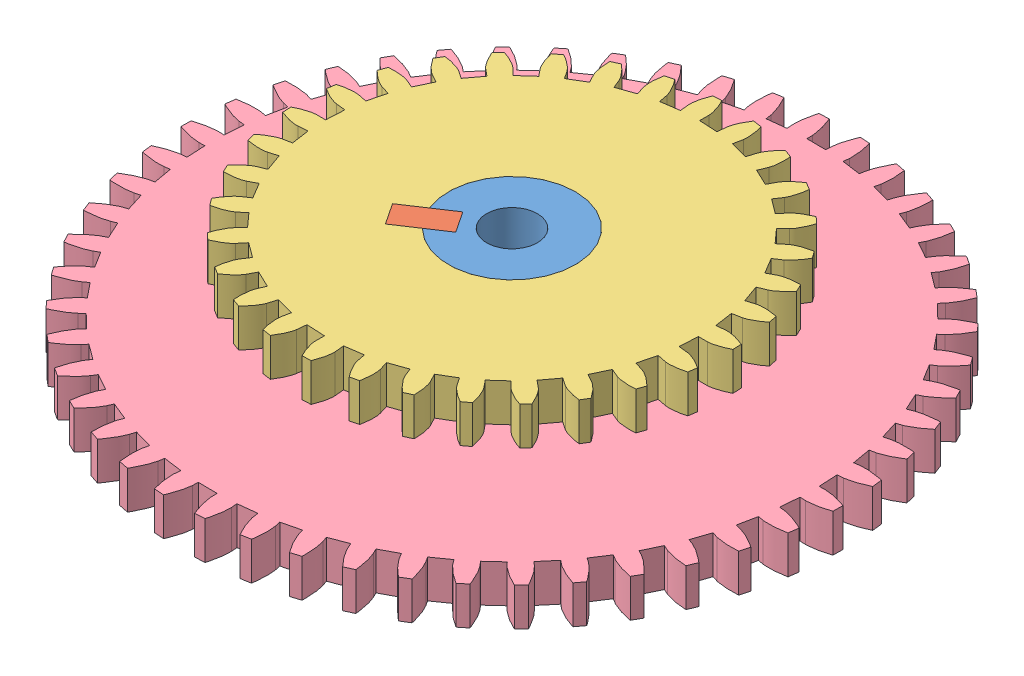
SolidWorks assembly Axle Assembly E Outer.SLDASM, configuration Default (file format 6000). Lengths in mm.
Overall size (36.03 4.5 36.03).
5 component instances, 4 part files, 13 mates.
Components (placement in the parent):
- Axle E Outer-1: Axle E Outer.SLDPRT [Default] at (-15.8192 13.6239 -1.4747) x (0.833282 0 -0.552847) z (0.552847 0 0.833282) size (5 4.5 5)
- Key-1: Key.SLDPRT [Default] at (-15.8192 16.6239 -1.4747) x (0.833282 0 -0.552847) z (0.552847 0 0.833282) size (2 1.5 1)
- Key-3: Key.SLDPRT [Default] at (-15.8192 13.6239 -1.4747) x (0.833282 0 -0.552847) z (0.552847 0 0.833282) size (2 1.5 1)
- Gear 32T Axle E Gear 2-3: Gear 32T Axle E Gear 2.sldprt [Default] at (-13.736 16.6239 -2.8568) x (-0.552847 0 -0.833282) z (0.833282 0 -0.552847) size (16.99 1.5 16.99)
- Gear 50T Axle E Gear 5-2: Gear 50T Axle E Gear 5.sldprt [Default] at (-13.736 15.1239 -2.8568) x (0.552847 0 0.833282) z (0.833282 0 -0.552847) size (26 1.5 26)
Mates (geometry in assembly coordinates):
- Coincident5: coincident aligned: plane of Axle E Outer-1 through (-13.736 13.6239 -2.8568) normal (0 -1 0); plane of Key-3 through (-15.8192 13.6239 -1.4747) normal (0 -1 0)
- Coincident6: coincident anti-aligned: plane of Axle E Outer-1 through (-15.2623 16.6239 -2.4442) normal (0 1 0); plane of Key-1 through (-15.8192 16.6239 -1.4747) normal (0 -1 0)
- Coincident7: coincident anti-aligned: plane of Axle E Outer-1 through (-14.7095 16.6239 -1.6109) normal (-0.552847 0 -0.833282); plane of Key-1 through (-16.376 18.1239 -0.5052) normal (0.552847 0 0.833282)
- Coincident10: coincident anti-aligned: plane of Axle E Outer-1 through (-14.9859 13.6239 -2.0275) normal (-0.833282 0 0.552847); plane of Key-3 through (-14.7095 15.1239 -1.6109) normal (0.833282 0 -0.552847)
- Coincident28: coincident anti-aligned: plane of Axle E Outer-1 through (-15.2623 16.6239 -2.4442) normal (0 1 0); plane of Key-1 through (-15.8192 16.6239 -1.4747) normal (0 -1 0)
- Coincident31: coincident anti-aligned: plane of Axle E Outer-1 through (-14.7095 13.6239 -1.6109) normal (-0.552847 0 -0.833282); plane of Key-3 through (-16.376 15.1239 -0.5052) normal (0.552847 0 0.833282)
- Coincident32: coincident anti-aligned: plane of Axle E Outer-1 through (-14.9859 13.6239 -2.0275) normal (-0.833282 0 0.552847); plane of Key-1 through (-14.7095 18.1239 -1.6109) normal (0.833282 0 -0.552847)
- Coincident33: coincident aligned: plane of Key-1 through (-15.8192 18.1239 -1.4747) normal (0 1 0); plane of Gear 32T Axle E Gear 2-3 through (-6.1231 18.1239 4.5408) normal (0 1 0)
- Concentric1: concentric aligned: cylinder of Axle E Outer-1 through (-13.736 18.1239 -2.8568) axis (0 -1 0) radius 2.5; cylinder of Gear 32T Axle E Gear 2-3 through (-13.736 18.1239 -2.8568) axis (0 -1 0) radius 2.5
- Parallel1: parallel aligned: line of Key-1 through (-16.9289 18.1239 -1.3385) axis (0.552847 0 0.833282); line of Gear 32T Axle E Gear 2-3 through (-16.9289 18.1239 -1.3385) axis (0.552847 0 0.833282)
- Coincident35: coincident aligned: plane of Key-3 through (-15.8192 13.6239 -1.4747) normal (0 -1 0); plane of Gear 50T Axle E Gear 5-2 through (-19.5752 13.6239 -19.8127) normal (0 -1 0)
- Concentric2: concentric anti-aligned: cylinder of Axle E Outer-1 through (-13.736 18.1239 -2.8568) axis (0 -1 0) radius 2.5; cylinder of Gear 50T Axle E Gear 5-2 through (-13.736 13.6239 -2.8568) axis (0 1 0) radius 2.5
- Parallel2: parallel anti-aligned: line of Key-3 through (-16.9289 13.6239 -1.3385) axis (0.552847 0 0.833282); line of Gear 50T Axle E Gear 5-2 through (-16.376 13.6239 -0.5052) axis (-0.552847 0 -0.833282)
